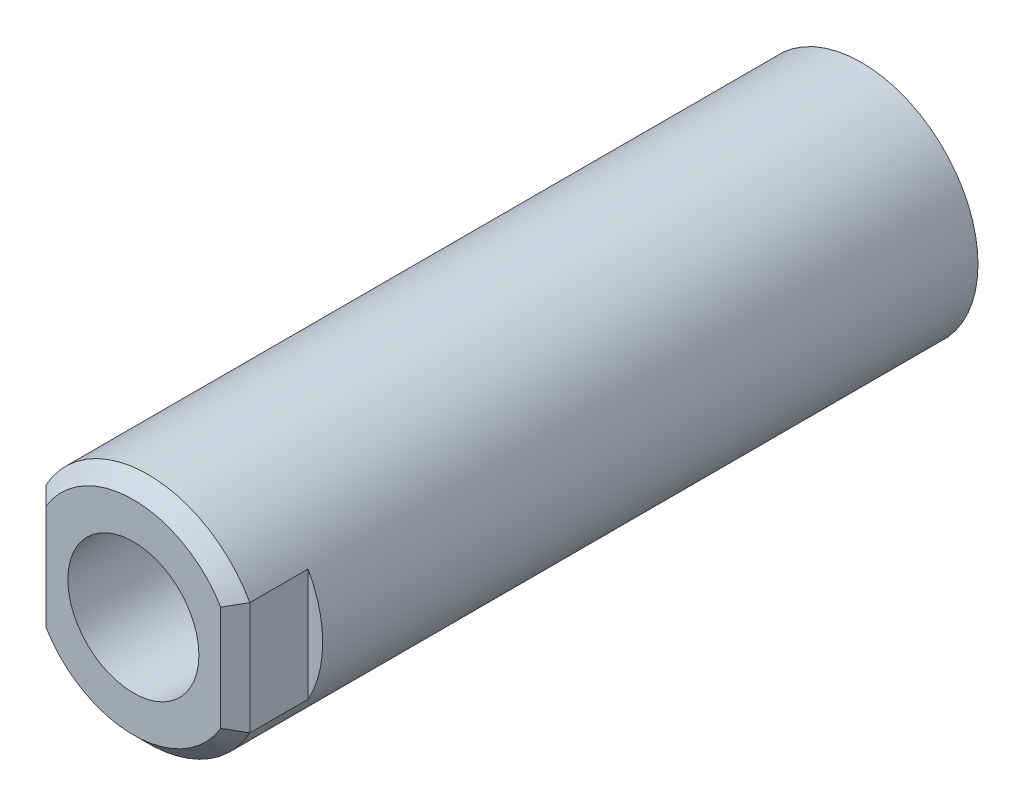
ISO-10303-21;
HEADER;
FILE_DESCRIPTION(('STEP AP214'),'2;1');
FILE_NAME('part.step','',(''),(''),'','','');
FILE_SCHEMA(('AUTOMOTIVE_DESIGN { 1 0 10303 214 1 1 1 1 }'));
ENDSEC;
DATA;
#1=APPLICATION_CONTEXT('core data for automotive mechanical design processes');
#2=APPLICATION_PROTOCOL_DEFINITION('international standard','automotive_design',2000,#1);
#3=PRODUCT_CONTEXT('',#1,'mechanical');
#4=PRODUCT('Part','Part','',(#3));
#5=PRODUCT_RELATED_PRODUCT_CATEGORY('part','',(#4));
#6=PRODUCT_DEFINITION_FORMATION('','',#4);
#7=PRODUCT_DEFINITION_CONTEXT('part definition',#1,'design');
#8=PRODUCT_DEFINITION('design','',#6,#7);
#9=PRODUCT_DEFINITION_SHAPE('','',#8);
#10=(LENGTH_UNIT() NAMED_UNIT(*) SI_UNIT(.MILLI.,.METRE.));
#11=(NAMED_UNIT(*) PLANE_ANGLE_UNIT() SI_UNIT($,.RADIAN.));
#12=(NAMED_UNIT(*) SI_UNIT($,.STERADIAN.) SOLID_ANGLE_UNIT());
#13=UNCERTAINTY_MEASURE_WITH_UNIT(LENGTH_MEASURE(1.E-05),#10,'distance_accuracy_value','');
#14=(GEOMETRIC_REPRESENTATION_CONTEXT(3) GLOBAL_UNCERTAINTY_ASSIGNED_CONTEXT((#13)) GLOBAL_UNIT_ASSIGNED_CONTEXT((#10,
#11,#12)) REPRESENTATION_CONTEXT('',''));
#15=CARTESIAN_POINT('',(0.,0.,0.));
#16=DIRECTION('',(0.,0.,1.));
#17=DIRECTION('',(1.,0.,0.));
#18=AXIS2_PLACEMENT_3D('',#15,#16,#17);
#19=CARTESIAN_POINT('',(0.,0.,-50.));
#20=DIRECTION('',(0.,0.,1.));
#21=DIRECTION('',(1.,0.,0.));
#22=AXIS2_PLACEMENT_3D('',#19,#20,#21);
#23=PLANE('',#22);
#24=CARTESIAN_POINT('',(0.,0.,-50.));
#25=DIRECTION('',(0.,0.,1.));
#26=DIRECTION('',(1.,0.,0.));
#27=AXIS2_PLACEMENT_3D('',#24,#25,#26);
#28=CIRCLE('',#27,8.);
#29=CARTESIAN_POINT('',(8.,0.,-50.));
#30=VERTEX_POINT('',#29);
#31=EDGE_CURVE('E207',#30,#30,#28,.T.);
#32=ORIENTED_EDGE('',*,*,#31,.F.);
#33=EDGE_LOOP('',(#32));
#34=FACE_BOUND('',#33,.T.);
#35=ADVANCED_FACE('F37',(#34),#23,.F.);
#36=CARTESIAN_POINT('',(7.,-10.,-5.));
#37=DIRECTION('',(0.,0.,-1.));
#38=DIRECTION('',(-1.,0.,0.));
#39=AXIS2_PLACEMENT_3D('',#36,#37,#38);
#40=PLANE('',#39);
#41=CARTESIAN_POINT('',(0.,0.,-5.));
#42=DIRECTION('',(0.,0.,-1.));
#43=DIRECTION('',(-1.,0.,0.));
#44=AXIS2_PLACEMENT_3D('',#41,#42,#43);
#45=CIRCLE('',#44,8.);
#46=CARTESIAN_POINT('',(7.,-3.87298334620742,-5.));
#47=VERTEX_POINT('',#46);
#48=CARTESIAN_POINT('',(7.,3.87298334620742,-5.));
#49=VERTEX_POINT('',#48);
#50=EDGE_CURVE('E210',#47,#49,#45,.F.);
#51=ORIENTED_EDGE('',*,*,#50,.T.);
#52=DIRECTION('',(0.,1.,0.));
#53=VECTOR('',#52,1.);
#54=CARTESIAN_POINT('',(7.,-10.,-5.));
#55=LINE('',#54,#53);
#56=EDGE_CURVE('E112',#47,#49,#55,.T.);
#57=ORIENTED_EDGE('',*,*,#56,.F.);
#58=EDGE_LOOP('',(#51,#57));
#59=FACE_BOUND('',#58,.T.);
#60=ADVANCED_FACE('F168',(#59),#40,.F.);
#61=CARTESIAN_POINT('',(-9.5,-10.,-5.));
#62=DIRECTION('',(0.,0.,-1.));
#63=DIRECTION('',(-1.,0.,0.));
#64=AXIS2_PLACEMENT_3D('',#61,#62,#63);
#65=PLANE('',#64);
#66=CARTESIAN_POINT('',(0.,0.,-5.));
#67=DIRECTION('',(0.,0.,-1.));
#68=DIRECTION('',(-1.,0.,0.));
#69=AXIS2_PLACEMENT_3D('',#66,#67,#68);
#70=CIRCLE('',#69,8.);
#71=CARTESIAN_POINT('',(-7.,3.87298334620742,-5.));
#72=VERTEX_POINT('',#71);
#73=CARTESIAN_POINT('',(-7.,-3.87298334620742,-5.));
#74=VERTEX_POINT('',#73);
#75=EDGE_CURVE('E107',#72,#74,#70,.F.);
#76=ORIENTED_EDGE('',*,*,#75,.T.);
#77=DIRECTION('',(0.,1.,0.));
#78=VECTOR('',#77,1.);
#79=CARTESIAN_POINT('',(-7.,-10.,-5.));
#80=LINE('',#79,#78);
#81=EDGE_CURVE('E102',#74,#72,#80,.T.);
#82=ORIENTED_EDGE('',*,*,#81,.T.);
#83=EDGE_LOOP('',(#76,#82));
#84=FACE_BOUND('',#83,.T.);
#85=ADVANCED_FACE('F110',(#84),#65,.F.);
#86=CARTESIAN_POINT('',(0.,0.,-50.));
#87=DIRECTION('',(0.,0.,1.));
#88=DIRECTION('',(1.,0.,0.));
#89=AXIS2_PLACEMENT_3D('',#86,#87,#88);
#90=CYLINDRICAL_SURFACE('',#89,8.);
#91=DIRECTION('',(0.,0.,1.));
#92=VECTOR('',#91,1.);
#93=CARTESIAN_POINT('',(7.,-3.87298334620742,-50.));
#94=LINE('',#93,#92);
#95=CARTESIAN_POINT('',(7.,-3.87298334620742,-1.));
#96=VERTEX_POINT('',#95);
#97=EDGE_CURVE('E119',#96,#47,#94,.F.);
#98=ORIENTED_EDGE('',*,*,#97,.F.);
#99=CARTESIAN_POINT('',(0.,0.,-1.));
#100=DIRECTION('',(0.,0.,1.));
#101=DIRECTION('',(1.,0.,0.));
#102=AXIS2_PLACEMENT_3D('',#99,#100,#101);
#103=CIRCLE('',#102,8.);
#104=CARTESIAN_POINT('',(-7.,-3.87298334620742,-1.));
#105=VERTEX_POINT('',#104);
#106=EDGE_CURVE('E50',#96,#105,#103,.F.);
#107=ORIENTED_EDGE('',*,*,#106,.T.);
#108=DIRECTION('',(0.,0.,1.));
#109=VECTOR('',#108,1.);
#110=CARTESIAN_POINT('',(-7.,-3.87298334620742,-50.));
#111=LINE('',#110,#109);
#112=EDGE_CURVE('E117',#74,#105,#111,.T.);
#113=ORIENTED_EDGE('',*,*,#112,.F.);
#114=ORIENTED_EDGE('',*,*,#75,.F.);
#115=DIRECTION('',(0.,0.,1.));
#116=VECTOR('',#115,1.);
#117=CARTESIAN_POINT('',(-7.,3.87298334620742,-50.));
#118=LINE('',#117,#116);
#119=CARTESIAN_POINT('',(-7.,3.87298334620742,-1.));
#120=VERTEX_POINT('',#119);
#121=EDGE_CURVE('E98',#120,#72,#118,.F.);
#122=ORIENTED_EDGE('',*,*,#121,.F.);
#123=CARTESIAN_POINT('',(0.,0.,-1.));
#124=DIRECTION('',(0.,0.,1.));
#125=DIRECTION('',(1.,0.,0.));
#126=AXIS2_PLACEMENT_3D('',#123,#124,#125);
#127=CIRCLE('',#126,8.);
#128=CARTESIAN_POINT('',(7.,3.87298334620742,-1.));
#129=VERTEX_POINT('',#128);
#130=EDGE_CURVE('E64',#120,#129,#127,.F.);
#131=ORIENTED_EDGE('',*,*,#130,.T.);
#132=DIRECTION('',(0.,0.,1.));
#133=VECTOR('',#132,1.);
#134=CARTESIAN_POINT('',(7.,3.87298334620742,-50.));
#135=LINE('',#134,#133);
#136=EDGE_CURVE('E216',#49,#129,#135,.T.);
#137=ORIENTED_EDGE('',*,*,#136,.F.);
#138=ORIENTED_EDGE('',*,*,#50,.F.);
#139=EDGE_LOOP('',(#98,#107,#113,#114,#122,#131,#137,#138));
#140=FACE_BOUND('',#139,.T.);
#141=ORIENTED_EDGE('',*,*,#31,.T.);
#142=EDGE_LOOP('',(#141));
#143=FACE_BOUND('',#142,.T.);
#144=ADVANCED_FACE('F115',(#140,#143),#90,.T.);
#145=CARTESIAN_POINT('',(7.,-10.,0.));
#146=DIRECTION('',(-1.,0.,0.));
#147=DIRECTION('',(0.,0.,1.));
#148=AXIS2_PLACEMENT_3D('',#145,#146,#147);
#149=PLANE('',#148);
#150=ORIENTED_EDGE('',*,*,#136,.T.);
#151=DIRECTION('',(0.,-1.,0.));
#152=VECTOR('',#151,1.);
#153=CARTESIAN_POINT('',(7.,-3.87298334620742,-0.999999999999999));
#154=LINE('',#153,#152);
#155=EDGE_CURVE('E11',#129,#96,#154,.T.);
#156=ORIENTED_EDGE('',*,*,#155,.T.);
#157=ORIENTED_EDGE('',*,*,#97,.T.);
#158=ORIENTED_EDGE('',*,*,#56,.T.);
#159=EDGE_LOOP('',(#150,#156,#157,#158));
#160=FACE_BOUND('',#159,.T.);
#161=ADVANCED_FACE('F181',(#160),#149,.F.);
#162=CARTESIAN_POINT('',(-7.,-10.,0.));
#163=DIRECTION('',(1.,0.,0.));
#164=DIRECTION('',(0.,0.,-1.));
#165=AXIS2_PLACEMENT_3D('',#162,#163,#164);
#166=PLANE('',#165);
#167=ORIENTED_EDGE('',*,*,#112,.T.);
#168=DIRECTION('',(0.,1.,0.));
#169=VECTOR('',#168,1.);
#170=CARTESIAN_POINT('',(-7.,3.87298334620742,-0.999999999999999));
#171=LINE('',#170,#169);
#172=EDGE_CURVE('E105',#105,#120,#171,.T.);
#173=ORIENTED_EDGE('',*,*,#172,.T.);
#174=ORIENTED_EDGE('',*,*,#121,.T.);
#175=ORIENTED_EDGE('',*,*,#81,.F.);
#176=EDGE_LOOP('',(#167,#173,#174,#175));
#177=FACE_BOUND('',#176,.T.);
#178=ADVANCED_FACE('F101',(#177),#166,.F.);
#179=CARTESIAN_POINT('',(0.,0.,0.));
#180=DIRECTION('',(0.,0.,1.));
#181=DIRECTION('',(1.,0.,0.));
#182=AXIS2_PLACEMENT_3D('',#179,#180,#181);
#183=PLANE('',#182);
#184=CARTESIAN_POINT('',(0.,0.,0.));
#185=DIRECTION('',(0.,0.,1.));
#186=DIRECTION('',(1.,0.,0.));
#187=AXIS2_PLACEMENT_3D('',#184,#185,#186);
#188=CIRCLE('',#187,7.00000000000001);
#189=CARTESIAN_POINT('',(6.00000000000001,3.60555127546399,0.));
#190=VERTEX_POINT('',#189);
#191=CARTESIAN_POINT('',(-6.00000000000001,3.60555127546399,0.));
#192=VERTEX_POINT('',#191);
#193=EDGE_CURVE('E124',#190,#192,#188,.T.);
#194=ORIENTED_EDGE('',*,*,#193,.T.);
#195=DIRECTION('',(0.,-1.,0.));
#196=VECTOR('',#195,1.);
#197=CARTESIAN_POINT('',(-6.00000000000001,-3.87298334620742,0.));
#198=LINE('',#197,#196);
#199=CARTESIAN_POINT('',(-6.00000000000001,-3.60555127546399,0.));
#200=VERTEX_POINT('',#199);
#201=EDGE_CURVE('E130',#192,#200,#198,.T.);
#202=ORIENTED_EDGE('',*,*,#201,.T.);
#203=CARTESIAN_POINT('',(0.,0.,0.));
#204=DIRECTION('',(0.,0.,1.));
#205=DIRECTION('',(1.,0.,0.));
#206=AXIS2_PLACEMENT_3D('',#203,#204,#205);
#207=CIRCLE('',#206,7.00000000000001);
#208=CARTESIAN_POINT('',(6.00000000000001,-3.60555127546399,0.));
#209=VERTEX_POINT('',#208);
#210=EDGE_CURVE('E128',#200,#209,#207,.T.);
#211=ORIENTED_EDGE('',*,*,#210,.T.);
#212=DIRECTION('',(0.,1.,0.));
#213=VECTOR('',#212,1.);
#214=CARTESIAN_POINT('',(6.00000000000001,3.87298334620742,0.));
#215=LINE('',#214,#213);
#216=EDGE_CURVE('E126',#209,#190,#215,.T.);
#217=ORIENTED_EDGE('',*,*,#216,.T.);
#218=EDGE_LOOP('',(#194,#202,#211,#217));
#219=FACE_BOUND('',#218,.T.);
#220=CARTESIAN_POINT('',(0.,0.,0.));
#221=DIRECTION('',(0.,0.,1.));
#222=DIRECTION('',(1.,0.,0.));
#223=AXIS2_PLACEMENT_3D('',#220,#221,#222);
#224=CIRCLE('',#223,4.5);
#225=CARTESIAN_POINT('',(4.5,0.,0.));
#226=VERTEX_POINT('',#225);
#227=EDGE_CURVE('E113',#226,#226,#224,.F.);
#228=ORIENTED_EDGE('',*,*,#227,.T.);
#229=EDGE_LOOP('',(#228));
#230=FACE_BOUND('',#229,.T.);
#231=ADVANCED_FACE('F193',(#219,#230),#183,.T.);
#232=CARTESIAN_POINT('',(0.,0.,8.));
#233=DIRECTION('',(0.,0.,1.));
#234=DIRECTION('',(1.,0.,0.));
#235=AXIS2_PLACEMENT_3D('',#232,#233,#234);
#236=CYLINDRICAL_SURFACE('',#235,4.5);
#237=CARTESIAN_POINT('',(0.,0.,-14.));
#238=DIRECTION('',(0.,0.,1.));
#239=DIRECTION('',(1.,0.,0.));
#240=AXIS2_PLACEMENT_3D('',#237,#238,#239);
#241=CIRCLE('',#240,4.5);
#242=CARTESIAN_POINT('',(4.5,0.,-14.));
#243=VERTEX_POINT('',#242);
#244=EDGE_CURVE('E206',#243,#243,#241,.T.);
#245=ORIENTED_EDGE('',*,*,#244,.F.);
#246=EDGE_LOOP('',(#245));
#247=FACE_BOUND('',#246,.T.);
#248=ORIENTED_EDGE('',*,*,#227,.F.);
#249=EDGE_LOOP('',(#248));
#250=FACE_BOUND('',#249,.T.);
#251=ADVANCED_FACE('F178',(#247,#250),#236,.F.);
#252=CARTESIAN_POINT('',(0.,0.,-14.));
#253=DIRECTION('',(0.,0.,1.));
#254=DIRECTION('',(1.,0.,0.));
#255=AXIS2_PLACEMENT_3D('',#252,#253,#254);
#256=CONICAL_SURFACE('',#255,4.5,1.02974425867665);
#257=CARTESIAN_POINT('',(0.,0.,-16.703872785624));
#258=VERTEX_POINT('',#257);
#259=VERTEX_LOOP('',#258);
#260=FACE_BOUND('',#259,.T.);
#261=ORIENTED_EDGE('',*,*,#244,.T.);
#262=EDGE_LOOP('',(#261));
#263=FACE_BOUND('',#262,.T.);
#264=ADVANCED_FACE('F164',(#260,#263),#256,.F.);
#265=CARTESIAN_POINT('',(6.00000000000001,0.,0.));
#266=DIRECTION('',(0.707106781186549,0.,0.707106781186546));
#267=DIRECTION('',(0.707106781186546,0.,-0.707106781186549));
#268=AXIS2_PLACEMENT_3D('',#265,#266,#267);
#269=PLANE('',#268);
#270=CARTESIAN_POINT('',(6.00000000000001,3.60555127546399,0.));
#271=CARTESIAN_POINT('',(6.1664610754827,3.65166172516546,-0.166461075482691));
#272=CARTESIAN_POINT('',(6.33302500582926,3.69700297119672,-0.333025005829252));
#273=CARTESIAN_POINT('',(6.66635833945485,3.78614699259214,-0.666358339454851));
#274=CARTESIAN_POINT('',(6.83312774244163,3.82994977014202,-0.833127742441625));
#275=CARTESIAN_POINT('',(7.,3.87298334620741,-1.));
#276=B_SPLINE_CURVE_WITH_KNOTS('',3,(#270,#271,#272,#273,#274,#275),.UNSPECIFIED.,.F.,.F.,(4,2,
4),(0.,0.719643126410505,1.43928523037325),.UNSPECIFIED.);
#277=EDGE_CURVE('E223',#190,#129,#276,.T.);
#278=ORIENTED_EDGE('',*,*,#277,.F.);
#279=ORIENTED_EDGE('',*,*,#216,.F.);
#280=CARTESIAN_POINT('',(6.00000000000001,-3.60555127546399,0.));
#281=CARTESIAN_POINT('',(6.1664610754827,-3.65166172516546,-0.166461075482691));
#282=CARTESIAN_POINT('',(6.33302500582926,-3.69700297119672,-0.333025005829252));
#283=CARTESIAN_POINT('',(6.66635833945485,-3.78614699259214,-0.666358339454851));
#284=CARTESIAN_POINT('',(6.83312774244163,-3.82994977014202,-0.833127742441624));
#285=CARTESIAN_POINT('',(7.,-3.87298334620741,-1.));
#286=B_SPLINE_CURVE_WITH_KNOTS('',3,(#280,#281,#282,#283,#284,#285),.UNSPECIFIED.,.F.,.F.,(4,2,
4),(0.,0.719643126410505,1.43928523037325),.UNSPECIFIED.);
#287=EDGE_CURVE('E42',#96,#209,#286,.F.);
#288=ORIENTED_EDGE('',*,*,#287,.F.);
#289=ORIENTED_EDGE('',*,*,#155,.F.);
#290=EDGE_LOOP('',(#278,#279,#288,#289));
#291=FACE_BOUND('',#290,.T.);
#292=ADVANCED_FACE('F39',(#291),#269,.T.);
#293=CARTESIAN_POINT('',(0.,0.,0.));
#294=DIRECTION('',(0.,0.,-1.));
#295=DIRECTION('',(-1.,0.,0.));
#296=AXIS2_PLACEMENT_3D('',#293,#294,#295);
#297=CONICAL_SURFACE('',#296,7.00000000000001,0.785398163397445);
#298=ORIENTED_EDGE('',*,*,#287,.T.);
#299=ORIENTED_EDGE('',*,*,#210,.F.);
#300=CARTESIAN_POINT('',(-6.00000000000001,-3.60555127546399,0.));
#301=CARTESIAN_POINT('',(-6.1664610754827,-3.65166172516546,-0.166461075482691));
#302=CARTESIAN_POINT('',(-6.33302500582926,-3.69700297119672,-0.333025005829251));
#303=CARTESIAN_POINT('',(-6.66635833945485,-3.78614699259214,-0.666358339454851));
#304=CARTESIAN_POINT('',(-6.83312774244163,-3.82994977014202,-0.833127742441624));
#305=CARTESIAN_POINT('',(-7.,-3.87298334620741,-1.));
#306=B_SPLINE_CURVE_WITH_KNOTS('',3,(#300,#301,#302,#303,#304,#305),.UNSPECIFIED.,.F.,.F.,(4,2,
4),(0.,0.719643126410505,1.43928523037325),.UNSPECIFIED.);
#307=EDGE_CURVE('E142',#105,#200,#306,.F.);
#308=ORIENTED_EDGE('',*,*,#307,.F.);
#309=ORIENTED_EDGE('',*,*,#106,.F.);
#310=EDGE_LOOP('',(#298,#299,#308,#309));
#311=FACE_BOUND('',#310,.T.);
#312=ADVANCED_FACE('F153',(#311),#297,.T.);
#313=CARTESIAN_POINT('',(0.,0.,0.));
#314=DIRECTION('',(0.,0.,-1.));
#315=DIRECTION('',(-1.,0.,0.));
#316=AXIS2_PLACEMENT_3D('',#313,#314,#315);
#317=CONICAL_SURFACE('',#316,7.00000000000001,0.785398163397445);
#318=ORIENTED_EDGE('',*,*,#277,.T.);
#319=ORIENTED_EDGE('',*,*,#130,.F.);
#320=CARTESIAN_POINT('',(-7.,3.87298334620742,-1.));
#321=CARTESIAN_POINT('',(-6.83312774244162,3.82994977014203,-0.833127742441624));
#322=CARTESIAN_POINT('',(-6.66635833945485,3.78614699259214,-0.666358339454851));
#323=CARTESIAN_POINT('',(-6.33302500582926,3.69700297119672,-0.333025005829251));
#324=CARTESIAN_POINT('',(-6.1664610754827,3.65166172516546,-0.166461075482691));
#325=CARTESIAN_POINT('',(-6.00000000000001,3.60555127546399,0.));
#326=B_SPLINE_CURVE_WITH_KNOTS('',3,(#320,#321,#322,#323,#324,#325),.UNSPECIFIED.,.F.,.F.,(4,2,
4),(0.,0.719642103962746,1.43928523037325),.UNSPECIFIED.);
#327=EDGE_CURVE('E135',#192,#120,#326,.F.);
#328=ORIENTED_EDGE('',*,*,#327,.F.);
#329=ORIENTED_EDGE('',*,*,#193,.F.);
#330=EDGE_LOOP('',(#318,#319,#328,#329));
#331=FACE_BOUND('',#330,.T.);
#332=ADVANCED_FACE('F146',(#331),#317,.T.);
#333=CARTESIAN_POINT('',(-7.,-10.,-0.999999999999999));
#334=DIRECTION('',(-0.707106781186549,0.,0.707106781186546));
#335=DIRECTION('',(0.707106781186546,0.,0.707106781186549));
#336=AXIS2_PLACEMENT_3D('',#333,#334,#335);
#337=PLANE('',#336);
#338=ORIENTED_EDGE('',*,*,#307,.T.);
#339=ORIENTED_EDGE('',*,*,#201,.F.);
#340=ORIENTED_EDGE('',*,*,#327,.T.);
#341=ORIENTED_EDGE('',*,*,#172,.F.);
#342=EDGE_LOOP('',(#338,#339,#340,#341));
#343=FACE_BOUND('',#342,.T.);
#344=ADVANCED_FACE('F149',(#343),#337,.T.);
#345=CLOSED_SHELL('',(#35,#60,#85,#144,#161,#178,#231,#251,#264,#292,#312,#332,#344));
#346=MANIFOLD_SOLID_BREP('B2',#345);
#347=ADVANCED_BREP_SHAPE_REPRESENTATION('',(#18,#346),#14);
#348=SHAPE_DEFINITION_REPRESENTATION(#9,#347);
ENDSEC;
END-ISO-10303-21;
